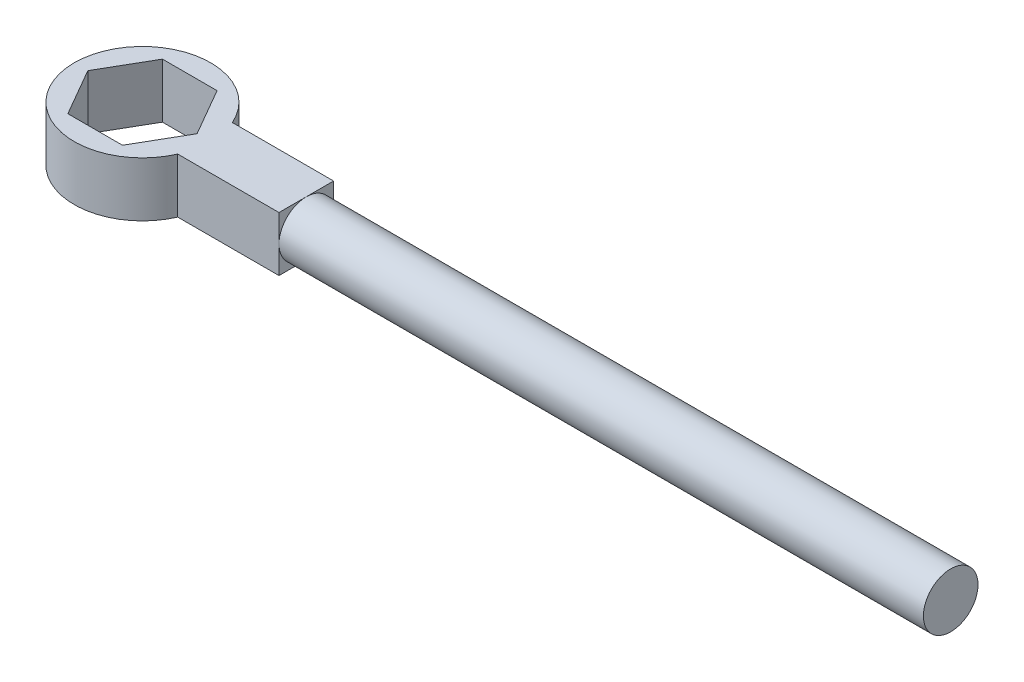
ISO-10303-21;
HEADER;
FILE_DESCRIPTION(('STEP AP214'),'2;1');
FILE_NAME('part.step','',(''),(''),'','','');
FILE_SCHEMA(('AUTOMOTIVE_DESIGN { 1 0 10303 214 1 1 1 1 }'));
ENDSEC;
DATA;
#1=APPLICATION_CONTEXT('core data for automotive mechanical design processes');
#2=APPLICATION_PROTOCOL_DEFINITION('international standard','automotive_design',2000,#1);
#3=PRODUCT_CONTEXT('',#1,'mechanical');
#4=PRODUCT('Part','Part','',(#3));
#5=PRODUCT_RELATED_PRODUCT_CATEGORY('part','',(#4));
#6=PRODUCT_DEFINITION_FORMATION('','',#4);
#7=PRODUCT_DEFINITION_CONTEXT('part definition',#1,'design');
#8=PRODUCT_DEFINITION('design','',#6,#7);
#9=PRODUCT_DEFINITION_SHAPE('','',#8);
#10=(LENGTH_UNIT() NAMED_UNIT(*) SI_UNIT(.MILLI.,.METRE.));
#11=(NAMED_UNIT(*) PLANE_ANGLE_UNIT() SI_UNIT($,.RADIAN.));
#12=(NAMED_UNIT(*) SI_UNIT($,.STERADIAN.) SOLID_ANGLE_UNIT());
#13=UNCERTAINTY_MEASURE_WITH_UNIT(LENGTH_MEASURE(1.E-05),#10,'distance_accuracy_value','');
#14=(GEOMETRIC_REPRESENTATION_CONTEXT(3) GLOBAL_UNCERTAINTY_ASSIGNED_CONTEXT((#13)) GLOBAL_UNIT_ASSIGNED_CONTEXT((#10,
#11,#12)) REPRESENTATION_CONTEXT('',''));
#15=CARTESIAN_POINT('',(0.,0.,0.));
#16=DIRECTION('',(0.,0.,1.));
#17=DIRECTION('',(1.,0.,0.));
#18=AXIS2_PLACEMENT_3D('',#15,#16,#17);
#19=CARTESIAN_POINT('',(3.,0.,0.));
#20=DIRECTION('',(1.,0.,0.));
#21=DIRECTION('',(0.,0.,-1.));
#22=AXIS2_PLACEMENT_3D('',#19,#20,#21);
#23=PLANE('',#22);
#24=CARTESIAN_POINT('',(3.,0.5,0.));
#25=DIRECTION('',(1.,0.,0.));
#26=DIRECTION('',(0.,0.,-1.));
#27=AXIS2_PLACEMENT_3D('',#24,#25,#26);
#28=CIRCLE('',#27,0.5);
#29=CARTESIAN_POINT('',(3.,0.5,-0.5));
#30=VERTEX_POINT('',#29);
#31=CARTESIAN_POINT('',(3.,1.,0.));
#32=VERTEX_POINT('',#31);
#33=EDGE_CURVE('E11',#30,#32,#28,.T.);
#34=ORIENTED_EDGE('',*,*,#33,.F.);
#35=DIRECTION('',(0.,1.,0.));
#36=VECTOR('',#35,1.);
#37=CARTESIAN_POINT('',(3.,0.,-0.5));
#38=LINE('',#37,#36);
#39=CARTESIAN_POINT('',(3.,1.,-0.5));
#40=VERTEX_POINT('',#39);
#41=EDGE_CURVE('E126',#30,#40,#38,.T.);
#42=ORIENTED_EDGE('',*,*,#41,.T.);
#43=DIRECTION('',(0.,0.,1.));
#44=VECTOR('',#43,1.);
#45=CARTESIAN_POINT('',(3.,1.,-0.5));
#46=LINE('',#45,#44);
#47=EDGE_CURVE('E137',#40,#32,#46,.T.);
#48=ORIENTED_EDGE('',*,*,#47,.T.);
#49=EDGE_LOOP('',(#34,#42,#48));
#50=FACE_BOUND('',#49,.T.);
#51=ADVANCED_FACE('F32',(#50),#23,.T.);
#52=CARTESIAN_POINT('',(3.,0.5,0.5));
#53=VERTEX_POINT('',#52);
#54=EDGE_CURVE('E41',#32,#53,#28,.T.);
#55=ORIENTED_EDGE('',*,*,#54,.F.);
#56=CARTESIAN_POINT('',(3.,1.,0.5));
#57=VERTEX_POINT('',#56);
#58=EDGE_CURVE('E125',#32,#57,#46,.T.);
#59=ORIENTED_EDGE('',*,*,#58,.T.);
#60=DIRECTION('',(0.,-1.,0.));
#61=VECTOR('',#60,1.);
#62=CARTESIAN_POINT('',(3.,0.,0.5));
#63=LINE('',#62,#61);
#64=EDGE_CURVE('E212',#57,#53,#63,.T.);
#65=ORIENTED_EDGE('',*,*,#64,.T.);
#66=EDGE_LOOP('',(#55,#59,#65));
#67=FACE_BOUND('',#66,.T.);
#68=ADVANCED_FACE('F245',(#67),#23,.T.);
#69=CARTESIAN_POINT('',(3.,0.,0.));
#70=VERTEX_POINT('',#69);
#71=EDGE_CURVE('E142',#53,#70,#28,.T.);
#72=ORIENTED_EDGE('',*,*,#71,.F.);
#73=CARTESIAN_POINT('',(3.,0.,0.5));
#74=VERTEX_POINT('',#73);
#75=EDGE_CURVE('E214',#53,#74,#63,.T.);
#76=ORIENTED_EDGE('',*,*,#75,.T.);
#77=DIRECTION('',(0.,0.,-1.));
#78=VECTOR('',#77,1.);
#79=CARTESIAN_POINT('',(3.,0.,-0.5));
#80=LINE('',#79,#78);
#81=EDGE_CURVE('E136',#74,#70,#80,.T.);
#82=ORIENTED_EDGE('',*,*,#81,.T.);
#83=EDGE_LOOP('',(#72,#76,#82));
#84=FACE_BOUND('',#83,.T.);
#85=ADVANCED_FACE('F221',(#84),#23,.T.);
#86=CARTESIAN_POINT('',(0.,1.,0.));
#87=DIRECTION('',(0.,1.,0.));
#88=DIRECTION('',(0.,0.,1.));
#89=AXIS2_PLACEMENT_3D('',#86,#87,#88);
#90=PLANE('',#89);
#91=ORIENTED_EDGE('',*,*,#58,.F.);
#92=ORIENTED_EDGE('',*,*,#47,.F.);
#93=DIRECTION('',(1.,0.,0.));
#94=VECTOR('',#93,1.);
#95=CARTESIAN_POINT('',(-1.251,1.,-0.5));
#96=LINE('',#95,#94);
#97=CARTESIAN_POINT('',(1.14564392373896,1.,-0.5));
#98=VERTEX_POINT('',#97);
#99=EDGE_CURVE('E132',#98,#40,#96,.T.);
#100=ORIENTED_EDGE('',*,*,#99,.F.);
#101=CARTESIAN_POINT('',(0.,1.,0.));
#102=DIRECTION('',(0.,1.,0.));
#103=DIRECTION('',(0.,0.,1.));
#104=AXIS2_PLACEMENT_3D('',#101,#102,#103);
#105=CIRCLE('',#104,1.25);
#106=CARTESIAN_POINT('',(1.14564392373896,1.,0.5));
#107=VERTEX_POINT('',#106);
#108=EDGE_CURVE('E143',#98,#107,#105,.T.);
#109=ORIENTED_EDGE('',*,*,#108,.T.);
#110=DIRECTION('',(1.,0.,0.));
#111=VECTOR('',#110,1.);
#112=CARTESIAN_POINT('',(-1.251,1.,0.5));
#113=LINE('',#112,#111);
#114=EDGE_CURVE('E202',#107,#57,#113,.T.);
#115=ORIENTED_EDGE('',*,*,#114,.T.);
#116=EDGE_LOOP('',(#91,#92,#100,#109,#115));
#117=FACE_BOUND('',#116,.T.);
#118=DIRECTION('',(-0.5,0.,-0.866025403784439));
#119=VECTOR('',#118,1.);
#120=CARTESIAN_POINT('',(1.,1.,0.));
#121=LINE('',#120,#119);
#122=CARTESIAN_POINT('',(1.,1.,0.));
#123=VERTEX_POINT('',#122);
#124=CARTESIAN_POINT('',(0.5,1.,-0.866025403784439));
#125=VERTEX_POINT('',#124);
#126=EDGE_CURVE('E195',#123,#125,#121,.T.);
#127=ORIENTED_EDGE('',*,*,#126,.F.);
#128=DIRECTION('',(0.5,0.,-0.866025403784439));
#129=VECTOR('',#128,1.);
#130=CARTESIAN_POINT('',(0.5,1.,0.866025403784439));
#131=LINE('',#130,#129);
#132=CARTESIAN_POINT('',(0.5,1.,0.866025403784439));
#133=VERTEX_POINT('',#132);
#134=EDGE_CURVE('E170',#133,#123,#131,.T.);
#135=ORIENTED_EDGE('',*,*,#134,.F.);
#136=DIRECTION('',(1.,0.,0.));
#137=VECTOR('',#136,1.);
#138=CARTESIAN_POINT('',(-0.5,1.,0.866025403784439));
#139=LINE('',#138,#137);
#140=CARTESIAN_POINT('',(-0.5,1.,0.866025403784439));
#141=VERTEX_POINT('',#140);
#142=EDGE_CURVE('E166',#141,#133,#139,.T.);
#143=ORIENTED_EDGE('',*,*,#142,.F.);
#144=DIRECTION('',(0.5,0.,0.866025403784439));
#145=VECTOR('',#144,1.);
#146=CARTESIAN_POINT('',(-1.,1.,0.));
#147=LINE('',#146,#145);
#148=CARTESIAN_POINT('',(-1.,1.,0.));
#149=VERTEX_POINT('',#148);
#150=EDGE_CURVE('E188',#149,#141,#147,.T.);
#151=ORIENTED_EDGE('',*,*,#150,.F.);
#152=DIRECTION('',(-0.5,0.,0.866025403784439));
#153=VECTOR('',#152,1.);
#154=CARTESIAN_POINT('',(-0.5,1.,-0.866025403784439));
#155=LINE('',#154,#153);
#156=CARTESIAN_POINT('',(-0.5,1.,-0.866025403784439));
#157=VERTEX_POINT('',#156);
#158=EDGE_CURVE('E191',#157,#149,#155,.T.);
#159=ORIENTED_EDGE('',*,*,#158,.F.);
#160=DIRECTION('',(-1.,0.,0.));
#161=VECTOR('',#160,1.);
#162=CARTESIAN_POINT('',(0.5,1.,-0.866025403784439));
#163=LINE('',#162,#161);
#164=EDGE_CURVE('E193',#125,#157,#163,.T.);
#165=ORIENTED_EDGE('',*,*,#164,.F.);
#166=EDGE_LOOP('',(#127,#135,#143,#151,#159,#165));
#167=FACE_BOUND('',#166,.T.);
#168=ADVANCED_FACE('F243',(#117,#167),#90,.T.);
#169=CARTESIAN_POINT('',(0.,0.,0.));
#170=DIRECTION('',(0.,1.,0.));
#171=DIRECTION('',(0.,0.,1.));
#172=AXIS2_PLACEMENT_3D('',#169,#170,#171);
#173=PLANE('',#172);
#174=CARTESIAN_POINT('',(3.,0.,-0.5));
#175=VERTEX_POINT('',#174);
#176=EDGE_CURVE('E122',#70,#175,#80,.T.);
#177=ORIENTED_EDGE('',*,*,#176,.F.);
#178=ORIENTED_EDGE('',*,*,#81,.F.);
#179=DIRECTION('',(1.,0.,0.));
#180=VECTOR('',#179,1.);
#181=CARTESIAN_POINT('',(-1.251,0.,0.5));
#182=LINE('',#181,#180);
#183=CARTESIAN_POINT('',(1.14564392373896,0.,0.5));
#184=VERTEX_POINT('',#183);
#185=EDGE_CURVE('E186',#184,#74,#182,.T.);
#186=ORIENTED_EDGE('',*,*,#185,.F.);
#187=CARTESIAN_POINT('',(0.,0.,0.));
#188=DIRECTION('',(0.,1.,0.));
#189=DIRECTION('',(0.,0.,1.));
#190=AXIS2_PLACEMENT_3D('',#187,#188,#189);
#191=CIRCLE('',#190,1.25);
#192=CARTESIAN_POINT('',(1.14564392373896,0.,-0.5));
#193=VERTEX_POINT('',#192);
#194=EDGE_CURVE('E145',#193,#184,#191,.T.);
#195=ORIENTED_EDGE('',*,*,#194,.F.);
#196=DIRECTION('',(1.,0.,0.));
#197=VECTOR('',#196,1.);
#198=CARTESIAN_POINT('',(-1.251,0.,-0.5));
#199=LINE('',#198,#197);
#200=EDGE_CURVE('E198',#193,#175,#199,.T.);
#201=ORIENTED_EDGE('',*,*,#200,.T.);
#202=EDGE_LOOP('',(#177,#178,#186,#195,#201));
#203=FACE_BOUND('',#202,.T.);
#204=DIRECTION('',(0.5,0.,-0.866025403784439));
#205=VECTOR('',#204,1.);
#206=CARTESIAN_POINT('',(0.5,0.,0.866025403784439));
#207=LINE('',#206,#205);
#208=CARTESIAN_POINT('',(0.5,0.,0.866025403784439));
#209=VERTEX_POINT('',#208);
#210=CARTESIAN_POINT('',(1.,0.,0.));
#211=VERTEX_POINT('',#210);
#212=EDGE_CURVE('E183',#209,#211,#207,.T.);
#213=ORIENTED_EDGE('',*,*,#212,.T.);
#214=DIRECTION('',(-0.5,0.,-0.866025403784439));
#215=VECTOR('',#214,1.);
#216=CARTESIAN_POINT('',(1.,0.,0.));
#217=LINE('',#216,#215);
#218=CARTESIAN_POINT('',(0.5,0.,-0.866025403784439));
#219=VERTEX_POINT('',#218);
#220=EDGE_CURVE('E180',#211,#219,#217,.T.);
#221=ORIENTED_EDGE('',*,*,#220,.T.);
#222=DIRECTION('',(-1.,0.,0.));
#223=VECTOR('',#222,1.);
#224=CARTESIAN_POINT('',(0.5,0.,-0.866025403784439));
#225=LINE('',#224,#223);
#226=CARTESIAN_POINT('',(-0.5,0.,-0.866025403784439));
#227=VERTEX_POINT('',#226);
#228=EDGE_CURVE('E177',#219,#227,#225,.T.);
#229=ORIENTED_EDGE('',*,*,#228,.T.);
#230=DIRECTION('',(-0.5,0.,0.866025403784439));
#231=VECTOR('',#230,1.);
#232=CARTESIAN_POINT('',(-0.5,0.,-0.866025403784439));
#233=LINE('',#232,#231);
#234=CARTESIAN_POINT('',(-1.,0.,0.));
#235=VERTEX_POINT('',#234);
#236=EDGE_CURVE('E174',#227,#235,#233,.T.);
#237=ORIENTED_EDGE('',*,*,#236,.T.);
#238=DIRECTION('',(0.5,0.,0.866025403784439));
#239=VECTOR('',#238,1.);
#240=CARTESIAN_POINT('',(-1.,0.,0.));
#241=LINE('',#240,#239);
#242=CARTESIAN_POINT('',(-0.5,0.,0.866025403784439));
#243=VERTEX_POINT('',#242);
#244=EDGE_CURVE('E171',#235,#243,#241,.T.);
#245=ORIENTED_EDGE('',*,*,#244,.T.);
#246=DIRECTION('',(1.,0.,0.));
#247=VECTOR('',#246,1.);
#248=CARTESIAN_POINT('',(-0.5,0.,0.866025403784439));
#249=LINE('',#248,#247);
#250=EDGE_CURVE('E167',#243,#209,#249,.T.);
#251=ORIENTED_EDGE('',*,*,#250,.T.);
#252=EDGE_LOOP('',(#213,#221,#229,#237,#245,#251));
#253=FACE_BOUND('',#252,.T.);
#254=ADVANCED_FACE('F230',(#203,#253),#173,.F.);
#255=CARTESIAN_POINT('',(0.,1.,0.));
#256=DIRECTION('',(0.,-1.,0.));
#257=DIRECTION('',(0.,0.,-1.));
#258=AXIS2_PLACEMENT_3D('',#255,#256,#257);
#259=CYLINDRICAL_SURFACE('',#258,1.25);
#260=ORIENTED_EDGE('',*,*,#108,.F.);
#261=DIRECTION('',(0.,-1.,0.));
#262=VECTOR('',#261,1.);
#263=CARTESIAN_POINT('',(1.14564392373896,1.,-0.5));
#264=LINE('',#263,#262);
#265=EDGE_CURVE('E200',#193,#98,#264,.F.);
#266=ORIENTED_EDGE('',*,*,#265,.F.);
#267=ORIENTED_EDGE('',*,*,#194,.T.);
#268=DIRECTION('',(0.,-1.,0.));
#269=VECTOR('',#268,1.);
#270=CARTESIAN_POINT('',(1.14564392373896,1.,0.5));
#271=LINE('',#270,#269);
#272=EDGE_CURVE('E204',#107,#184,#271,.T.);
#273=ORIENTED_EDGE('',*,*,#272,.F.);
#274=EDGE_LOOP('',(#260,#266,#267,#273));
#275=FACE_BOUND('',#274,.T.);
#276=ADVANCED_FACE('F34',(#275),#259,.T.);
#277=CARTESIAN_POINT('',(0.5,1.,0.866025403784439));
#278=DIRECTION('',(-0.866025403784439,0.,-0.5));
#279=DIRECTION('',(-0.5,0.,0.866025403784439));
#280=AXIS2_PLACEMENT_3D('',#277,#278,#279);
#281=PLANE('',#280);
#282=ORIENTED_EDGE('',*,*,#212,.F.);
#283=DIRECTION('',(0.,-1.,0.));
#284=VECTOR('',#283,1.);
#285=CARTESIAN_POINT('',(0.5,1.,0.866025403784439));
#286=LINE('',#285,#284);
#287=EDGE_CURVE('E163',#133,#209,#286,.T.);
#288=ORIENTED_EDGE('',*,*,#287,.F.);
#289=ORIENTED_EDGE('',*,*,#134,.T.);
#290=DIRECTION('',(0.,-1.,0.));
#291=VECTOR('',#290,1.);
#292=CARTESIAN_POINT('',(1.,1.,0.));
#293=LINE('',#292,#291);
#294=EDGE_CURVE('E151',#123,#211,#293,.T.);
#295=ORIENTED_EDGE('',*,*,#294,.T.);
#296=EDGE_LOOP('',(#282,#288,#289,#295));
#297=FACE_BOUND('',#296,.T.);
#298=ADVANCED_FACE('F235',(#297),#281,.T.);
#299=CARTESIAN_POINT('',(1.,1.,0.));
#300=DIRECTION('',(-0.866025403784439,0.,0.5));
#301=DIRECTION('',(0.5,0.,0.866025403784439));
#302=AXIS2_PLACEMENT_3D('',#299,#300,#301);
#303=PLANE('',#302);
#304=ORIENTED_EDGE('',*,*,#220,.F.);
#305=ORIENTED_EDGE('',*,*,#294,.F.);
#306=ORIENTED_EDGE('',*,*,#126,.T.);
#307=DIRECTION('',(0.,-1.,0.));
#308=VECTOR('',#307,1.);
#309=CARTESIAN_POINT('',(0.5,1.,-0.866025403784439));
#310=LINE('',#309,#308);
#311=EDGE_CURVE('E155',#125,#219,#310,.T.);
#312=ORIENTED_EDGE('',*,*,#311,.T.);
#313=EDGE_LOOP('',(#304,#305,#306,#312));
#314=FACE_BOUND('',#313,.T.);
#315=ADVANCED_FACE('F240',(#314),#303,.T.);
#316=CARTESIAN_POINT('',(0.5,1.,-0.866025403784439));
#317=DIRECTION('',(0.,0.,1.));
#318=DIRECTION('',(1.,0.,0.));
#319=AXIS2_PLACEMENT_3D('',#316,#317,#318);
#320=PLANE('',#319);
#321=ORIENTED_EDGE('',*,*,#228,.F.);
#322=ORIENTED_EDGE('',*,*,#311,.F.);
#323=ORIENTED_EDGE('',*,*,#164,.T.);
#324=DIRECTION('',(0.,-1.,0.));
#325=VECTOR('',#324,1.);
#326=CARTESIAN_POINT('',(-0.5,1.,-0.866025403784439));
#327=LINE('',#326,#325);
#328=EDGE_CURVE('E157',#157,#227,#327,.T.);
#329=ORIENTED_EDGE('',*,*,#328,.T.);
#330=EDGE_LOOP('',(#321,#322,#323,#329));
#331=FACE_BOUND('',#330,.T.);
#332=ADVANCED_FACE('F270',(#331),#320,.T.);
#333=CARTESIAN_POINT('',(-0.5,1.,-0.866025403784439));
#334=DIRECTION('',(0.866025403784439,0.,0.5));
#335=DIRECTION('',(0.5,0.,-0.866025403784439));
#336=AXIS2_PLACEMENT_3D('',#333,#334,#335);
#337=PLANE('',#336);
#338=ORIENTED_EDGE('',*,*,#236,.F.);
#339=ORIENTED_EDGE('',*,*,#328,.F.);
#340=ORIENTED_EDGE('',*,*,#158,.T.);
#341=DIRECTION('',(0.,-1.,0.));
#342=VECTOR('',#341,1.);
#343=CARTESIAN_POINT('',(-1.,1.,0.));
#344=LINE('',#343,#342);
#345=EDGE_CURVE('E159',#149,#235,#344,.T.);
#346=ORIENTED_EDGE('',*,*,#345,.T.);
#347=EDGE_LOOP('',(#338,#339,#340,#346));
#348=FACE_BOUND('',#347,.T.);
#349=ADVANCED_FACE('F274',(#348),#337,.T.);
#350=CARTESIAN_POINT('',(-1.,1.,0.));
#351=DIRECTION('',(0.866025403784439,0.,-0.5));
#352=DIRECTION('',(-0.5,0.,-0.866025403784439));
#353=AXIS2_PLACEMENT_3D('',#350,#351,#352);
#354=PLANE('',#353);
#355=ORIENTED_EDGE('',*,*,#244,.F.);
#356=ORIENTED_EDGE('',*,*,#345,.F.);
#357=ORIENTED_EDGE('',*,*,#150,.T.);
#358=DIRECTION('',(0.,-1.,0.));
#359=VECTOR('',#358,1.);
#360=CARTESIAN_POINT('',(-0.5,1.,0.866025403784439));
#361=LINE('',#360,#359);
#362=EDGE_CURVE('E161',#141,#243,#361,.T.);
#363=ORIENTED_EDGE('',*,*,#362,.T.);
#364=EDGE_LOOP('',(#355,#356,#357,#363));
#365=FACE_BOUND('',#364,.T.);
#366=ADVANCED_FACE('F278',(#365),#354,.T.);
#367=CARTESIAN_POINT('',(-0.5,1.,0.866025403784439));
#368=DIRECTION('',(0.,0.,-1.));
#369=DIRECTION('',(-1.,0.,0.));
#370=AXIS2_PLACEMENT_3D('',#367,#368,#369);
#371=PLANE('',#370);
#372=ORIENTED_EDGE('',*,*,#250,.F.);
#373=ORIENTED_EDGE('',*,*,#362,.F.);
#374=ORIENTED_EDGE('',*,*,#142,.T.);
#375=ORIENTED_EDGE('',*,*,#287,.T.);
#376=EDGE_LOOP('',(#372,#373,#374,#375));
#377=FACE_BOUND('',#376,.T.);
#378=ADVANCED_FACE('F282',(#377),#371,.T.);
#379=CARTESIAN_POINT('',(-1.251,0.,-0.5));
#380=DIRECTION('',(0.,0.,-1.));
#381=DIRECTION('',(-1.,0.,0.));
#382=AXIS2_PLACEMENT_3D('',#379,#380,#381);
#383=PLANE('',#382);
#384=ORIENTED_EDGE('',*,*,#41,.F.);
#385=EDGE_CURVE('E119',#175,#30,#38,.T.);
#386=ORIENTED_EDGE('',*,*,#385,.F.);
#387=ORIENTED_EDGE('',*,*,#200,.F.);
#388=ORIENTED_EDGE('',*,*,#265,.T.);
#389=ORIENTED_EDGE('',*,*,#99,.T.);
#390=EDGE_LOOP('',(#384,#386,#387,#388,#389));
#391=FACE_BOUND('',#390,.T.);
#392=ADVANCED_FACE('F130',(#391),#383,.T.);
#393=CARTESIAN_POINT('',(-1.251,0.,0.5));
#394=DIRECTION('',(0.,0.,1.));
#395=DIRECTION('',(1.,0.,0.));
#396=AXIS2_PLACEMENT_3D('',#393,#394,#395);
#397=PLANE('',#396);
#398=ORIENTED_EDGE('',*,*,#75,.F.);
#399=ORIENTED_EDGE('',*,*,#64,.F.);
#400=ORIENTED_EDGE('',*,*,#114,.F.);
#401=ORIENTED_EDGE('',*,*,#272,.T.);
#402=ORIENTED_EDGE('',*,*,#185,.T.);
#403=EDGE_LOOP('',(#398,#399,#400,#401,#402));
#404=FACE_BOUND('',#403,.T.);
#405=ADVANCED_FACE('F226',(#404),#397,.T.);
#406=EDGE_CURVE('E36',#70,#30,#28,.T.);
#407=ORIENTED_EDGE('',*,*,#406,.F.);
#408=ORIENTED_EDGE('',*,*,#176,.T.);
#409=ORIENTED_EDGE('',*,*,#385,.T.);
#410=EDGE_LOOP('',(#407,#408,#409));
#411=FACE_BOUND('',#410,.T.);
#412=ADVANCED_FACE('F121',(#411),#23,.T.);
#413=CARTESIAN_POINT('',(-1.251,0.5,0.));
#414=DIRECTION('',(1.,0.,0.));
#415=DIRECTION('',(0.,0.,-1.));
#416=AXIS2_PLACEMENT_3D('',#413,#414,#415);
#417=CYLINDRICAL_SURFACE('',#416,0.5);
#418=ORIENTED_EDGE('',*,*,#406,.T.);
#419=ORIENTED_EDGE('',*,*,#33,.T.);
#420=ORIENTED_EDGE('',*,*,#54,.T.);
#421=ORIENTED_EDGE('',*,*,#71,.T.);
#422=EDGE_LOOP('',(#418,#419,#420,#421));
#423=FACE_BOUND('',#422,.T.);
#424=CARTESIAN_POINT('',(14.8,0.5,0.));
#425=DIRECTION('',(1.,0.,0.));
#426=DIRECTION('',(0.,0.,-1.));
#427=AXIS2_PLACEMENT_3D('',#424,#425,#426);
#428=CIRCLE('',#427,0.5);
#429=CARTESIAN_POINT('',(14.8,0.5,-0.5));
#430=VERTEX_POINT('',#429);
#431=EDGE_CURVE('E215',#430,#430,#428,.T.);
#432=ORIENTED_EDGE('',*,*,#431,.F.);
#433=EDGE_LOOP('',(#432));
#434=FACE_BOUND('',#433,.T.);
#435=ADVANCED_FACE('F140',(#423,#434),#417,.T.);
#436=CARTESIAN_POINT('',(14.8,0.5,0.));
#437=DIRECTION('',(1.,0.,0.));
#438=DIRECTION('',(0.,0.,-1.));
#439=AXIS2_PLACEMENT_3D('',#436,#437,#438);
#440=PLANE('',#439);
#441=ORIENTED_EDGE('',*,*,#431,.T.);
#442=EDGE_LOOP('',(#441));
#443=FACE_BOUND('',#442,.T.);
#444=ADVANCED_FACE('F257',(#443),#440,.T.);
#445=CLOSED_SHELL('',(#51,#68,#85,#168,#254,#276,#298,#315,#332,#349,#366,#378,#392,#405,#412,
#435,#444));
#446=MANIFOLD_SOLID_BREP('B2',#445);
#447=ADVANCED_BREP_SHAPE_REPRESENTATION('',(#18,#446),#14);
#448=SHAPE_DEFINITION_REPRESENTATION(#9,#447);
ENDSEC;
END-ISO-10303-21;
